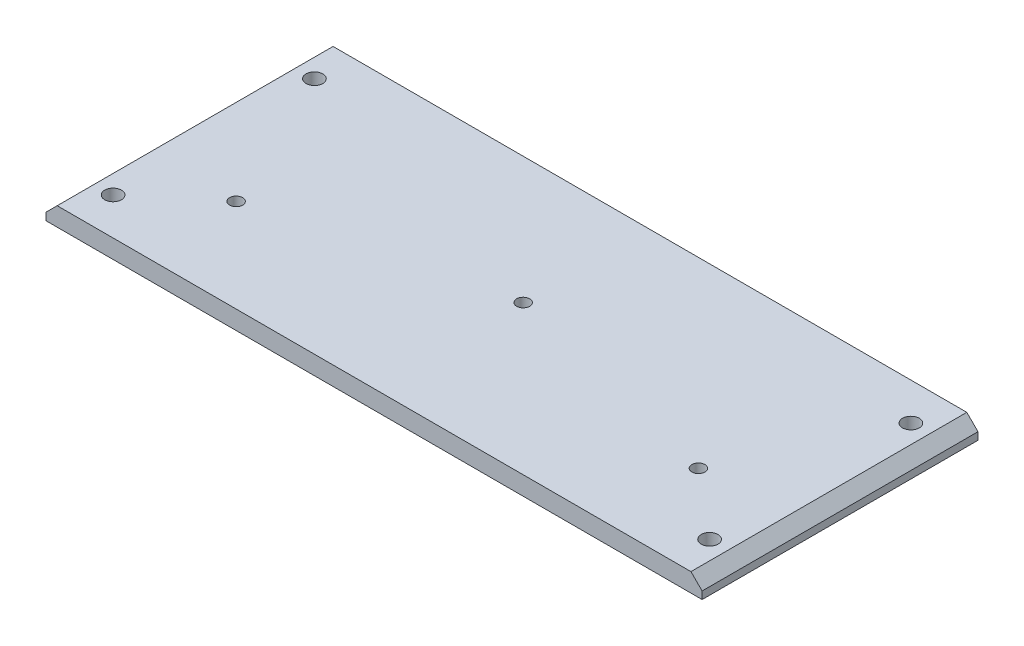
from build123d import *

# Parameters (mm, degrees)
SKETCH1_W      = 176
SKETCH1_H      = 74
SKETCH1_R      = 2.25
SKETCH1_R_2    = 1.75
EXTRUDE1_DEPTH = 5
CHAMFER1_SIZE  = 3


with BuildPart() as part:
    # Sketch1 → Extrude1 (new body)
    with BuildSketch(Plane(origin=(0, 0, 0), x_dir=(1, 0, 0), z_dir=(0, 1, 0))):
        with Locations((88, 37)):
            Rectangle(SKETCH1_W, SKETCH1_H)
        with Locations(Location((8, 10, 0), (0, 0, 270))):
            Circle(SKETCH1_R, mode=Mode.SUBTRACT)
        with Locations(Location((8, 64, 0), (0, 0, 270))):
            Circle(SKETCH1_R, mode=Mode.SUBTRACT)
        with Locations(Location((168, 64, 0), (0, 0, 270))):
            Circle(SKETCH1_R, mode=Mode.SUBTRACT)
        with Locations(Location((168, 10, 0), (0, 0, 270))):
            Circle(SKETCH1_R, mode=Mode.SUBTRACT)
        with Locations(Location((88, 40, 0), (0, 0, 270))):
            Circle(SKETCH1_R_2, mode=Mode.SUBTRACT)
        with Locations(Location((26, 25, 0), (0, 0, 270))):
            Circle(SKETCH1_R_2, mode=Mode.SUBTRACT)
        with Locations(Location((150, 25, 0), (0, 0, 270))):
            Circle(SKETCH1_R_2, mode=Mode.SUBTRACT)
    extrude(amount=EXTRUDE1_DEPTH)

    # Chamfer1
    chamfer1_edges = [part.edges().sort_by_distance(p)[0] for p in [
        (176, 5, -37),
        (0, 5, -37),
    ]]
    chamfer(chamfer1_edges, length=CHAMFER1_SIZE)


solid = part.part
